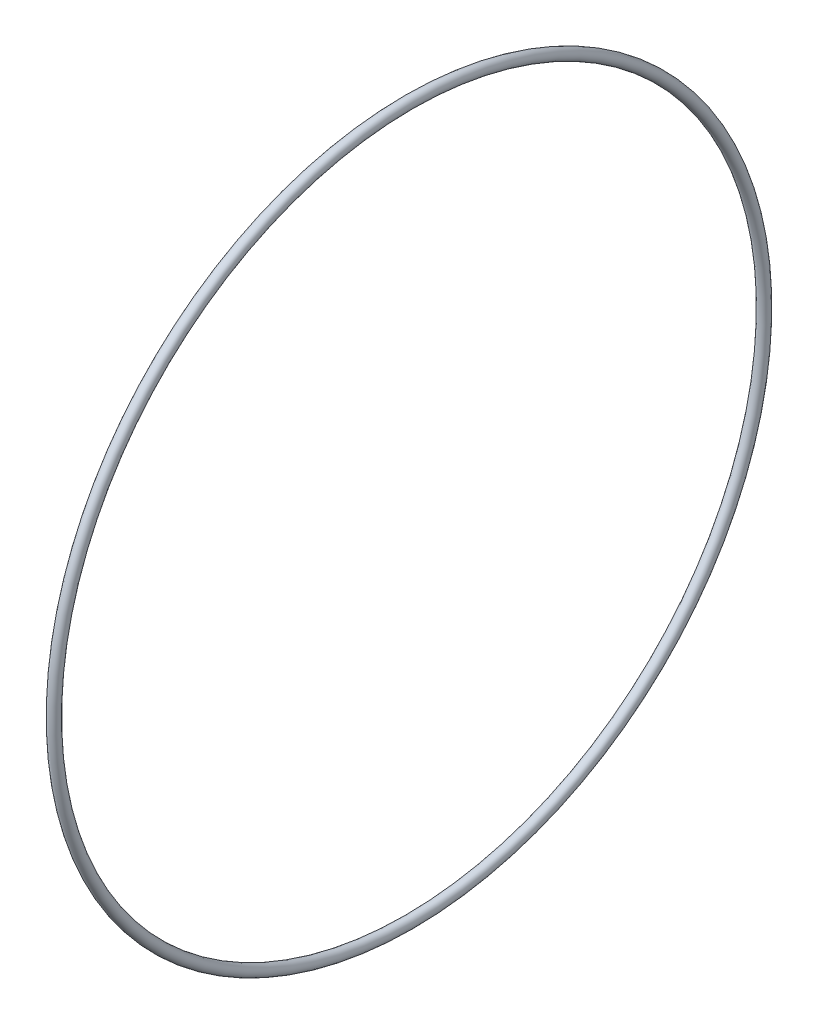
from build123d import *

# Parameters (mm, degrees)
SKETCH1_R = 0.889


with BuildPart() as part:
    # Sketch1 → Base-Revolve (revolve)
    with BuildSketch(Plane.XY, mode=Mode.PRIVATE) as base_revolve_sk:
        with Locations((0, 57.8993)):
            Circle(SKETCH1_R)
    revolve(base_revolve_sk.sketch.rotate(Axis((0, 0, 0), (1, 0, 0)), 180), axis=Axis((0, 0, 0), (1, 0, 0)))


solid = part.part
